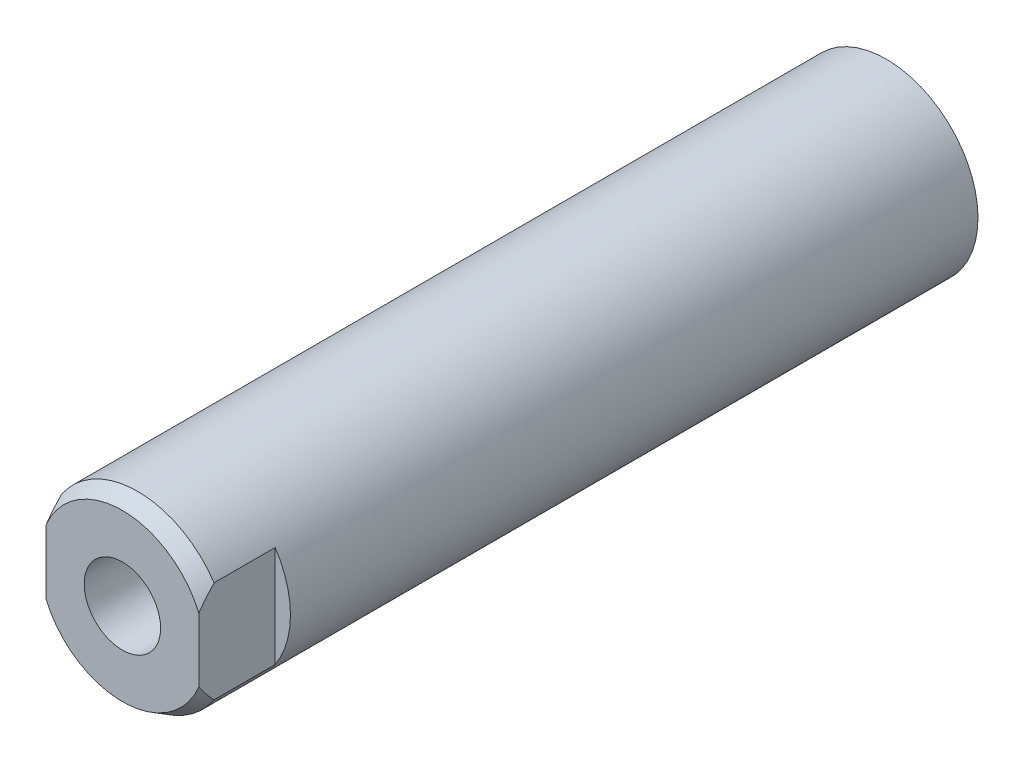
from build123d import *

# Parameters (mm, degrees)
SKETCH1_R             = 6
EXTRUDE1_DEPTH        = 50
EXTRUDE2_START        = 8
SKETCH2_R             = 6
EXTRUDE2_DEPTH        = 8
CHAMFER2_SIZE         = 0.5
SKETCH6_R             = 6.5
SKETCH6_R_2           = 5
CUT_EXTRUDE1_DEPTH    = 1
CHAMFER3_SIZE         = 1
CHAMFER3_SIZE2        = 0.577350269
SKETCH7_W             = 2.586449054
SKETCH7_H             = 5
SKETCH7_W_2           = 2.604137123
CUT_EXTRUDE2_DEPTH    = 10.5
SKETCH8_R             = 6
CUT_EXTRUDE3_DEPTH    = 8
M6_TAPPED_HOLE1_D     = 5
M6_TAPPED_HOLE1_DEPTH = 21
M6_TAPPED_HOLE1_TIP   = 1.502151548


with BuildPart() as part:
    # Sketch1 → Extrude1 (new body)
    with BuildSketch(Plane.XY):
        Circle(SKETCH1_R)
    extrude(amount=-EXTRUDE1_DEPTH)

    # Sketch2 → Extrude2 (add)
    with BuildSketch(Plane.XY.offset(EXTRUDE2_START)):
        Circle(SKETCH2_R)
    extrude(amount=-EXTRUDE2_DEPTH)

    # Chamfer2
    chamfer2_edges = [part.edges().sort_by_distance(p)[0] for p in [
        (-6, 0, 8),
    ]]
    chamfer(chamfer2_edges, length=CHAMFER2_SIZE)

    # Sketch6 → Cut-Extrude1 (cut)
    with BuildSketch(Plane.XY):
        Circle(SKETCH6_R)
        Circle(SKETCH6_R_2, mode=Mode.SUBTRACT)
    extrude(amount=CUT_EXTRUDE1_DEPTH, mode=Mode.SUBTRACT)

    # Chamfer3
    chamfer3_edges = [part.edges().sort_by_distance(p)[0] for p in [
        (-6, 0, 0),
    ]]
    chamfer3_side = [part.faces().sort_by_distance(p)[0] for p in [
        (-6, 0, -25),
    ]]
    chamfer(chamfer3_edges, length=CHAMFER3_SIZE, length2=CHAMFER3_SIZE2, reference=chamfer3_side[0])

    # Sketch7 → Cut-Extrude2 (cut, symmetric)
    with BuildSketch(Plane(origin=(0, 0, 0), x_dir=(1, 0, 0), z_dir=(0, 1, 0))):
        with Locations((6.293224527, 2.5)):
            Rectangle(SKETCH7_W, SKETCH7_H)
        with Locations((-6.302068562, 2.5)):
            Rectangle(SKETCH7_W_2, SKETCH7_H)
    extrude(amount=CUT_EXTRUDE2_DEPTH, both=True, mode=Mode.SUBTRACT)

    # Sketch8 → Cut-Extrude3 (cut)
    with BuildSketch(Plane.XY.offset(8)):
        Circle(SKETCH8_R)
    extrude(amount=-CUT_EXTRUDE3_DEPTH, mode=Mode.SUBTRACT)

    # M6 Tapped Hole1
    with Locations(Plane.XY):
        with Locations((0, 0)):
            Hole(M6_TAPPED_HOLE1_D / 2, depth=M6_TAPPED_HOLE1_DEPTH)
            with Locations((0, 0, -(M6_TAPPED_HOLE1_DEPTH + M6_TAPPED_HOLE1_TIP / 2))):  # 118° drill point
                Cone(0, M6_TAPPED_HOLE1_D / 2, M6_TAPPED_HOLE1_TIP, mode=Mode.SUBTRACT)


solid = part.part
